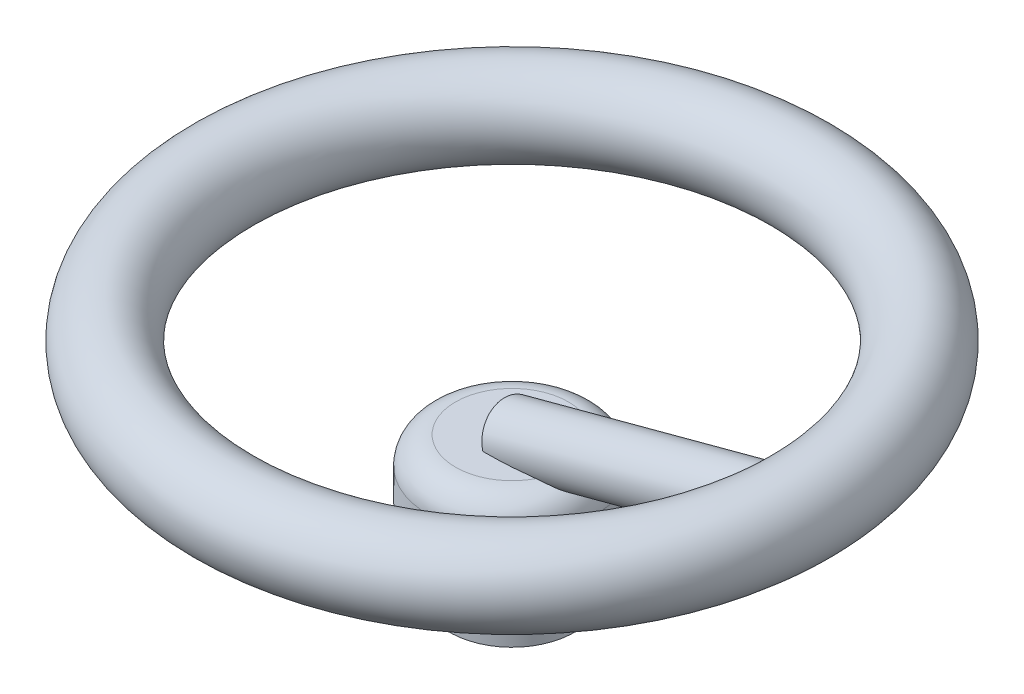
ISO-10303-21;
HEADER;
FILE_DESCRIPTION(('STEP AP214'),'2;1');
FILE_NAME('part.step','',(''),(''),'','','');
FILE_SCHEMA(('AUTOMOTIVE_DESIGN { 1 0 10303 214 1 1 1 1 }'));
ENDSEC;
DATA;
#1=APPLICATION_CONTEXT('core data for automotive mechanical design processes');
#2=APPLICATION_PROTOCOL_DEFINITION('international standard','automotive_design',2000,#1);
#3=PRODUCT_CONTEXT('',#1,'mechanical');
#4=PRODUCT('Part','Part','',(#3));
#5=PRODUCT_RELATED_PRODUCT_CATEGORY('part','',(#4));
#6=PRODUCT_DEFINITION_FORMATION('','',#4);
#7=PRODUCT_DEFINITION_CONTEXT('part definition',#1,'design');
#8=PRODUCT_DEFINITION('design','',#6,#7);
#9=PRODUCT_DEFINITION_SHAPE('','',#8);
#10=(LENGTH_UNIT() NAMED_UNIT(*) SI_UNIT(.MILLI.,.METRE.));
#11=(NAMED_UNIT(*) PLANE_ANGLE_UNIT() SI_UNIT($,.RADIAN.));
#12=(NAMED_UNIT(*) SI_UNIT($,.STERADIAN.) SOLID_ANGLE_UNIT());
#13=UNCERTAINTY_MEASURE_WITH_UNIT(LENGTH_MEASURE(1.E-05),#10,'distance_accuracy_value','');
#14=(GEOMETRIC_REPRESENTATION_CONTEXT(3) GLOBAL_UNCERTAINTY_ASSIGNED_CONTEXT((#13)) GLOBAL_UNIT_ASSIGNED_CONTEXT((#10,
#11,#12)) REPRESENTATION_CONTEXT('',''));
#15=CARTESIAN_POINT('',(0.,0.,0.));
#16=DIRECTION('',(0.,0.,1.));
#17=DIRECTION('',(1.,0.,0.));
#18=AXIS2_PLACEMENT_3D('',#15,#16,#17);
#19=CARTESIAN_POINT('',(0.,0.,0.));
#20=DIRECTION('',(0.,-1.,0.));
#21=DIRECTION('',(1.,0.,0.));
#22=AXIS2_PLACEMENT_3D('',#19,#20,#21);
#23=PLANE('',#22);
#24=CARTESIAN_POINT('',(0.,0.,0.));
#25=DIRECTION('',(0.,-1.,0.));
#26=DIRECTION('',(-1.,0.,0.));
#27=AXIS2_PLACEMENT_3D('',#24,#25,#26);
#28=ELLIPSE('',#27,23.657072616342,6.12290094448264);
#29=CARTESIAN_POINT('',(0.,0.,6.12290094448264));
#30=VERTEX_POINT('',#29);
#31=CARTESIAN_POINT('',(10.5181258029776,0.,5.48443672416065));
#32=VERTEX_POINT('',#31);
#33=EDGE_CURVE('E47',#30,#32,#28,.F.);
#34=ORIENTED_EDGE('',*,*,#33,.F.);
#35=DIRECTION('',(0.,0.,1.));
#36=VECTOR('',#35,1.);
#37=CARTESIAN_POINT('',(0.,0.,0.));
#38=LINE('',#37,#36);
#39=CARTESIAN_POINT('',(0.,0.,-6.12290094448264));
#40=VERTEX_POINT('',#39);
#41=EDGE_CURVE('E11',#40,#30,#38,.T.);
#42=ORIENTED_EDGE('',*,*,#41,.F.);
#43=CARTESIAN_POINT('',(10.5181258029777,0.,-5.48443672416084));
#44=VERTEX_POINT('',#43);
#45=EDGE_CURVE('E62',#44,#40,#28,.F.);
#46=ORIENTED_EDGE('',*,*,#45,.F.);
#47=CARTESIAN_POINT('',(0.,0.,0.));
#48=DIRECTION('',(0.,1.,0.));
#49=DIRECTION('',(-1.,0.,0.));
#50=AXIS2_PLACEMENT_3D('',#47,#48,#49);
#51=CIRCLE('',#50,11.8621252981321);
#52=EDGE_CURVE('E57',#44,#32,#51,.T.);
#53=ORIENTED_EDGE('',*,*,#52,.T.);
#54=EDGE_LOOP('',(#34,#42,#46,#53));
#55=FACE_BOUND('',#54,.T.);
#56=ADVANCED_FACE('F33',(#55),#23,.F.);
#57=CARTESIAN_POINT('',(0.,-5.72295049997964,0.));
#58=DIRECTION('',(0.,1.,0.));
#59=DIRECTION('',(-1.,0.,0.));
#60=AXIS2_PLACEMENT_3D('',#57,#58,#59);
#61=TOROIDAL_SURFACE('',#60,11.8621252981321,5.72295049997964);
#62=CARTESIAN_POINT('',(0.,-5.72295049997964,0.));
#63=DIRECTION('',(0.,1.,0.));
#64=DIRECTION('',(-1.,0.,0.));
#65=AXIS2_PLACEMENT_3D('',#62,#63,#64);
#66=CIRCLE('',#65,17.5850757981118);
#67=CARTESIAN_POINT('',(-17.5850757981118,-5.72295049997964,0.));
#68=VERTEX_POINT('',#67);
#69=EDGE_CURVE('E60',#68,#68,#66,.T.);
#70=ORIENTED_EDGE('',*,*,#69,.T.);
#71=EDGE_LOOP('',(#70));
#72=FACE_BOUND('',#71,.T.);
#73=CARTESIAN_POINT('',(5.34523472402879,-2.26781724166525,-4.97156903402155));
#74=CARTESIAN_POINT('',(5.3037001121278,-2.35630006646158,-4.91784921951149));
#75=CARTESIAN_POINT('',(5.27120185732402,-2.44606167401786,-4.85899273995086));
#76=CARTESIAN_POINT('',(5.22564818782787,-2.62388686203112,-4.73199202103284));
#77=CARTESIAN_POINT('',(5.21260380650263,-2.71194945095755,-4.66384253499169));
#78=CARTESIAN_POINT('',(5.20267448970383,-2.90105199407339,-4.50500440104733));
#79=CARTESIAN_POINT('',(5.20984997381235,-3.00083059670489,-4.41261484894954));
#80=CARTESIAN_POINT('',(5.2416810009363,-3.19010628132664,-4.22044523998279));
#81=CARTESIAN_POINT('',(5.2664053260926,-3.27956129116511,-4.12063749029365));
#82=CARTESIAN_POINT('',(5.32495816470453,-3.44459166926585,-3.91993667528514));
#83=CARTESIAN_POINT('',(5.35836996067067,-3.52058683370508,-3.81925745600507));
#84=CARTESIAN_POINT('',(5.43023265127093,-3.66396462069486,-3.61357973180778));
#85=CARTESIAN_POINT('',(5.46868851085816,-3.73133862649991,-3.50857704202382));
#86=CARTESIAN_POINT('',(5.54752001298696,-3.85833287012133,-3.29444861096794));
#87=CARTESIAN_POINT('',(5.58789875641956,-3.91793996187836,-3.18531627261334));
#88=CARTESIAN_POINT('',(5.66824592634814,-4.02986223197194,-2.96329160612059));
#89=CARTESIAN_POINT('',(5.70821448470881,-4.0821798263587,-2.8504005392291));
#90=CARTESIAN_POINT('',(5.79189059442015,-4.18725076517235,-2.603816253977));
#91=CARTESIAN_POINT('',(5.83526361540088,-4.23889956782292,-2.46953657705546));
#92=CARTESIAN_POINT('',(5.91729470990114,-4.3334147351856,-2.19649501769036));
#93=CARTESIAN_POINT('',(5.95595225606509,-4.3762801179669,-2.05773263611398));
#94=CARTESIAN_POINT('',(6.02698849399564,-4.45326168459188,-1.77639529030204));
#95=CARTESIAN_POINT('',(6.05937431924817,-4.48738782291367,-1.63382486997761));
#96=CARTESIAN_POINT('',(6.11673645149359,-4.54691010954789,-1.34541043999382));
#97=CARTESIAN_POINT('',(6.14171322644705,-4.5723068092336,-1.1995666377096));
#98=CARTESIAN_POINT('',(6.18588343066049,-4.61680712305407,-0.887700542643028));
#99=CARTESIAN_POINT('',(6.20401788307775,-4.63478426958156,-0.721363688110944));
#100=CARTESIAN_POINT('',(6.2290709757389,-4.65953154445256,-0.387000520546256));
#101=CARTESIAN_POINT('',(6.23598862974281,-4.66630068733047,-0.218974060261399));
#102=CARTESIAN_POINT('',(6.23830429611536,-4.66857184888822,0.117210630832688));
#103=CARTESIAN_POINT('',(6.2337039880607,-4.66407551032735,0.285368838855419));
#104=CARTESIAN_POINT('',(6.21318701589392,-4.64385795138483,0.620296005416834));
#105=CARTESIAN_POINT('',(6.19727140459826,-4.62813777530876,0.787065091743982));
#106=CARTESIAN_POINT('',(6.15718721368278,-4.58795721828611,1.09943396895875));
#107=CARTESIAN_POINT('',(6.13412999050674,-4.5646598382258,1.24532989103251));
#108=CARTESIAN_POINT('',(6.08043866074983,-4.50938663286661,1.53405283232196));
#109=CARTESIAN_POINT('',(6.04980411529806,-4.47741030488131,1.67687967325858));
#110=CARTESIAN_POINT('',(5.98200015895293,-4.40477831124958,1.95898184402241));
#111=CARTESIAN_POINT('',(5.94481971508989,-4.36410796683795,2.09825071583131));
#112=CARTESIAN_POINT('',(5.86538365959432,-4.2740782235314,2.37243851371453));
#113=CARTESIAN_POINT('',(5.82312856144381,-4.22471970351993,2.50735787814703));
#114=CARTESIAN_POINT('',(5.73826208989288,-4.12063045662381,2.76373075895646));
#115=CARTESIAN_POINT('',(5.69585838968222,-4.06646949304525,2.88548524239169));
#116=CARTESIAN_POINT('',(5.6101246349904,-3.94991402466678,3.12474002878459));
#117=CARTESIAN_POINT('',(5.5667941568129,-3.88751568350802,3.24223831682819));
#118=CARTESIAN_POINT('',(5.48198610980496,-3.75401872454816,3.4723637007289));
#119=CARTESIAN_POINT('',(5.44050308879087,-3.68294839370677,3.58500509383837));
#120=CARTESIAN_POINT('',(5.36298448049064,-3.53103516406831,3.80537326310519));
#121=CARTESIAN_POINT('',(5.32694192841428,-3.45020500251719,3.91310619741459));
#122=CARTESIAN_POINT('',(5.27010166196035,-3.28996041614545,4.10799394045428));
#123=CARTESIAN_POINT('',(5.2478622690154,-3.21199074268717,4.19589107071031));
#124=CARTESIAN_POINT('',(5.21616040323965,-3.04796294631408,4.36627582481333));
#125=CARTESIAN_POINT('',(5.20667797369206,-2.96191768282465,4.44877170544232));
#126=CARTESIAN_POINT('',(5.20596359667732,-2.7813910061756,4.6076739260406));
#127=CARTESIAN_POINT('',(5.21502297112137,-2.68679759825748,4.68396317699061));
#128=CARTESIAN_POINT('',(5.24552957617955,-2.54279418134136,4.79041984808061));
#129=CARTESIAN_POINT('',(5.25851835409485,-2.49444008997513,4.82457631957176));
#130=CARTESIAN_POINT('',(5.29012314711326,-2.39764958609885,4.89004744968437));
#131=CARTESIAN_POINT('',(5.30873874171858,-2.34921318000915,4.92136232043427));
#132=CARTESIAN_POINT('',(5.3661136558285,-2.21968260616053,5.00158669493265));
#133=CARTESIAN_POINT('',(5.40991500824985,-2.13907965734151,5.04775409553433));
#134=CARTESIAN_POINT('',(5.51046671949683,-1.98183346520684,5.13192111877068));
#135=CARTESIAN_POINT('',(5.56723568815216,-1.9051961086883,5.16990884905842));
#136=CARTESIAN_POINT('',(5.72731511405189,-1.71308649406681,5.25925551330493));
#137=CARTESIAN_POINT('',(5.83827024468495,-1.60151373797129,5.30519791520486));
#138=CARTESIAN_POINT('',(6.07622213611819,-1.39165865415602,5.38407109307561));
#139=CARTESIAN_POINT('',(6.20326897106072,-1.29341988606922,5.41695986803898));
#140=CARTESIAN_POINT('',(6.45288371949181,-1.11972612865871,5.47000749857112));
#141=CARTESIAN_POINT('',(6.57433643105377,-1.042951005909,5.49118467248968));
#142=CARTESIAN_POINT('',(6.82336314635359,-0.898350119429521,5.52765697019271));
#143=CARTESIAN_POINT('',(6.95094156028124,-0.830530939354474,5.54294778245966));
#144=CARTESIAN_POINT('',(7.21085973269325,-0.70326345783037,5.5687278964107));
#145=CARTESIAN_POINT('',(7.34320569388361,-0.643826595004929,5.57921068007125));
#146=CARTESIAN_POINT('',(7.61151645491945,-0.533062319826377,5.59603279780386));
#147=CARTESIAN_POINT('',(7.7474821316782,-0.481736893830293,5.60237111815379));
#148=CARTESIAN_POINT('',(8.07841988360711,-0.367621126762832,5.6131584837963));
#149=CARTESIAN_POINT('',(8.27480161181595,-0.308715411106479,5.6157773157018));
#150=CARTESIAN_POINT('',(8.67154522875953,-0.206287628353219,5.61414563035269));
#151=CARTESIAN_POINT('',(8.87190850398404,-0.162771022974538,5.60989267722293));
#152=CARTESIAN_POINT('',(9.27502236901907,-0.0910511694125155,5.59442997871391));
#153=CARTESIAN_POINT('',(9.47777210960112,-0.0628426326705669,5.58322263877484));
#154=CARTESIAN_POINT('',(9.88423723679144,-0.0216224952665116,5.55332106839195));
#155=CARTESIAN_POINT('',(10.087952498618,-0.0086089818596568,5.53462778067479));
#156=CARTESIAN_POINT('',(10.495784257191,0.00247651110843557,5.48874063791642));
#157=CARTESIAN_POINT('',(10.6998983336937,0.000479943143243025,5.46150832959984));
#158=CARTESIAN_POINT('',(11.1059425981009,-0.0181492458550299,5.39734153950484));
#159=CARTESIAN_POINT('',(11.307872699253,-0.0347824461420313,5.36040667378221));
#160=CARTESIAN_POINT('',(11.7077167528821,-0.0818740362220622,5.27539011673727));
#161=CARTESIAN_POINT('',(11.905631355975,-0.112330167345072,5.22731024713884));
#162=CARTESIAN_POINT('',(12.295544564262,-0.185843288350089,5.11843207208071));
#163=CARTESIAN_POINT('',(12.4875435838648,-0.228899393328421,5.0576346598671));
#164=CARTESIAN_POINT('',(12.8563316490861,-0.324042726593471,4.92439052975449));
#165=CARTESIAN_POINT('',(13.0334217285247,-0.375717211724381,4.85248404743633));
#166=CARTESIAN_POINT('',(13.3783855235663,-0.487211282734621,4.69423850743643));
#167=CARTESIAN_POINT('',(13.5462591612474,-0.54703093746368,4.60789932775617));
#168=CARTESIAN_POINT('',(13.8707233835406,-0.672407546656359,4.41993759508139));
#169=CARTESIAN_POINT('',(14.0273252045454,-0.737958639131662,4.31833058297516));
#170=CARTESIAN_POINT('',(14.327573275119,-0.872156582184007,4.09925357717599));
#171=CARTESIAN_POINT('',(14.4712223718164,-0.940802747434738,3.98178708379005));
#172=CARTESIAN_POINT('',(14.724035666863,-1.06825890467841,3.74926903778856));
#173=CARTESIAN_POINT('',(14.8351768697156,-1.12704755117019,3.63635056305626));
#174=CARTESIAN_POINT('',(15.0458264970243,-1.24285765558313,3.39931786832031));
#175=CARTESIAN_POINT('',(15.1453368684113,-1.29987940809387,3.27520552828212));
#176=CARTESIAN_POINT('',(15.3318832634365,-1.41027171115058,3.01653030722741));
#177=CARTESIAN_POINT('',(15.4189257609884,-1.46364414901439,2.8819729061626));
#178=CARTESIAN_POINT('',(15.5799453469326,-1.56501241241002,2.60335202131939));
#179=CARTESIAN_POINT('',(15.653924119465,-1.61300893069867,2.45928976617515));
#180=CARTESIAN_POINT('',(15.7791307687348,-1.69595951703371,2.18322142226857));
#181=CARTESIAN_POINT('',(15.8320864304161,-1.7317995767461,2.05226118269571));
#182=CARTESIAN_POINT('',(15.9276726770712,-1.7974338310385,1.78516395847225));
#183=CARTESIAN_POINT('',(15.9703042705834,-1.82722861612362,1.64902748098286));
#184=CARTESIAN_POINT('',(16.0450698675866,-1.88004638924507,1.37266456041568));
#185=CARTESIAN_POINT('',(16.0772069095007,-1.90307133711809,1.23243931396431));
#186=CARTESIAN_POINT('',(16.1308928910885,-1.94181055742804,0.948982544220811));
#187=CARTESIAN_POINT('',(16.1524420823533,-1.95752500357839,0.805751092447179));
#188=CARTESIAN_POINT('',(16.1838847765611,-1.98053715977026,0.526379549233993));
#189=CARTESIAN_POINT('',(16.1944166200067,-1.98829523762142,0.390348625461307));
#190=CARTESIAN_POINT('',(16.2060808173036,-1.996890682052,0.11766838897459));
#191=CARTESIAN_POINT('',(16.2072134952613,-1.99772828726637,-0.0189809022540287));
#192=CARTESIAN_POINT('',(16.2000776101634,-1.99246587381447,-0.291876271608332));
#193=CARTESIAN_POINT('',(16.1918106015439,-1.98636700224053,-0.428122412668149));
#194=CARTESIAN_POINT('',(16.1658976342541,-1.967360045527,-0.699241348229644));
#195=CARTESIAN_POINT('',(16.1482516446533,-1.95445193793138,-0.834114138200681));
#196=CARTESIAN_POINT('',(16.1039319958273,-1.92231756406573,-1.09967688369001));
#197=CARTESIAN_POINT('',(16.0773852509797,-1.90318022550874,-1.23039882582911));
#198=CARTESIAN_POINT('',(16.0152751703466,-1.85892702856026,-1.48869626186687));
#199=CARTESIAN_POINT('',(15.9797088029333,-1.8338091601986,-1.61627068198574));
#200=CARTESIAN_POINT('',(15.8996850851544,-1.77812282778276,-1.86733708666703));
#201=CARTESIAN_POINT('',(15.8552300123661,-1.74755576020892,-1.99083010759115));
#202=CARTESIAN_POINT('',(15.7575780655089,-1.6815999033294,-2.23298033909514));
#203=CARTESIAN_POINT('',(15.7043807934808,-1.6462108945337,-2.35163732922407));
#204=CARTESIAN_POINT('',(15.5885581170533,-1.57076644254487,-2.58520936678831));
#205=CARTESIAN_POINT('',(15.5257984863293,-1.53064677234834,-2.70003707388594));
#206=CARTESIAN_POINT('',(15.3917628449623,-1.44706398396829,-2.92332687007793));
#207=CARTESIAN_POINT('',(15.3204865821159,-1.40360076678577,-3.03178877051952));
#208=CARTESIAN_POINT('',(15.1697826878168,-1.31427853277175,-3.24180733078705));
#209=CARTESIAN_POINT('',(15.0903564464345,-1.26841992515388,-3.34336516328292));
#210=CARTESIAN_POINT('',(14.9237276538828,-1.17526618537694,-3.5392502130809));
#211=CARTESIAN_POINT('',(14.8365219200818,-1.12797047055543,-3.63357444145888));
#212=CARTESIAN_POINT('',(14.6498855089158,-1.0303726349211,-3.81964196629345));
#213=CARTESIAN_POINT('',(14.5500475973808,-0.980047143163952,-3.91096444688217));
#214=CARTESIAN_POINT('',(14.3429480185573,-0.880115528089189,-4.08510134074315));
#215=CARTESIAN_POINT('',(14.2356886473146,-0.830509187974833,-4.16791836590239));
#216=CARTESIAN_POINT('',(14.0143258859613,-0.733087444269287,-4.32517782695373));
#217=CARTESIAN_POINT('',(13.9002183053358,-0.685273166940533,-4.39961505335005));
#218=CARTESIAN_POINT('',(13.6659609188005,-0.592525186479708,-4.54023947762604));
#219=CARTESIAN_POINT('',(13.5458123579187,-0.547590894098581,-4.60642836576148));
#220=CARTESIAN_POINT('',(13.2867929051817,-0.456853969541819,-4.73768284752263));
#221=CARTESIAN_POINT('',(13.1473081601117,-0.411489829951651,-4.801840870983));
#222=CARTESIAN_POINT('',(12.8627746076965,-0.32659891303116,-4.92101700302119));
#223=CARTESIAN_POINT('',(12.7177254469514,-0.287072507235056,-4.976034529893));
#224=CARTESIAN_POINT('',(12.4230412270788,-0.214815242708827,-5.07761441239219));
#225=CARTESIAN_POINT('',(12.2734058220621,-0.182084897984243,-5.12417612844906));
#226=CARTESIAN_POINT('',(11.9705073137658,-0.124200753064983,-5.20957492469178));
#227=CARTESIAN_POINT('',(11.8172438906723,-0.0990476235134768,-5.24841132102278));
#228=CARTESIAN_POINT('',(11.4859230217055,-0.0539230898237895,-5.32414566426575));
#229=CARTESIAN_POINT('',(11.3074495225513,-0.0352040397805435,-5.35997539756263));
#230=CARTESIAN_POINT('',(10.9482461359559,-0.00911873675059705,-5.4235645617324));
#231=CARTESIAN_POINT('',(10.7675160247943,-0.00175361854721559,-5.45132318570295));
#232=CARTESIAN_POINT('',(10.4047014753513,0.00120114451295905,-5.49974533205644));
#233=CARTESIAN_POINT('',(10.2226152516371,-0.00322933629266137,-5.52039666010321));
#234=CARTESIAN_POINT('',(9.858534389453,-0.0241508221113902,-5.55530881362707));
#235=CARTESIAN_POINT('',(9.67653974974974,-0.0406416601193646,-5.56956972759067));
#236=CARTESIAN_POINT('',(9.29299237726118,-0.0883813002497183,-5.59356026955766));
#237=CARTESIAN_POINT('',(9.09157662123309,-0.121098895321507,-5.60258750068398));
#238=CARTESIAN_POINT('',(8.69154433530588,-0.201751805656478,-5.61381765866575));
#239=CARTESIAN_POINT('',(8.49292883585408,-0.249692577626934,-5.61601813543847));
#240=CARTESIAN_POINT('',(8.10051605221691,-0.36079856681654,-5.61351483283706));
#241=CARTESIAN_POINT('',(7.90670884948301,-0.423928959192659,-5.60882672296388));
#242=CARTESIAN_POINT('',(7.52534046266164,-0.565786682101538,-5.59189522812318));
#243=CARTESIAN_POINT('',(7.33777438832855,-0.644501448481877,-5.57965791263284));
#244=CARTESIAN_POINT('',(6.98786381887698,-0.810462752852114,-5.54758446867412));
#245=CARTESIAN_POINT('',(6.82477587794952,-0.89628496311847,-5.52853949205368));
#246=CARTESIAN_POINT('',(6.50849231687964,-1.08271055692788,-5.48071187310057));
#247=CARTESIAN_POINT('',(6.35529870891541,-1.18331693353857,-5.45192725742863));
#248=CARTESIAN_POINT('',(6.08841345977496,-1.3827154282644,-5.38680821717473));
#249=CARTESIAN_POINT('',(5.97239125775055,-1.479021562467,-5.35252828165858));
#250=CARTESIAN_POINT('',(5.75660135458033,-1.68364142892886,-5.27123958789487));
#251=CARTESIAN_POINT('',(5.65677398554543,-1.79190849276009,-5.22427933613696));
#252=CARTESIAN_POINT('',(5.52466256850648,-1.96356548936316,-5.14069294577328));
#253=CARTESIAN_POINT('',(5.48324641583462,-2.02295924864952,-5.11027302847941));
#254=CARTESIAN_POINT('',(5.4081413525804,-2.14396352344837,-5.04460561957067));
#255=CARTESIAN_POINT('',(5.37445225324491,-2.20557398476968,-5.00935824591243));
#256=CARTESIAN_POINT('',(5.34523472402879,-2.26781724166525,-4.97156903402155));
#257=B_SPLINE_CURVE_WITH_KNOTS('',3,(#73,#74,#75,#76,#77,#78,#79,#80,#81,#82,#83,#84,#85,#86,
#87,#88,#89,#90,#91,#92,#93,#94,#95,#96,#97,#98,#99,#100,#101,#102,#103,#104,#105,#106,#107,
#108,#109,#110,#111,#112,#113,#114,#115,#116,#117,#118,#119,#120,#121,#122,#123,#124,#125,#126,
#127,#128,#129,#130,#131,#132,#133,#134,#135,#136,#137,#138,#139,#140,#141,#142,#143,#144,#145,
#146,#147,#148,#149,#150,#151,#152,#153,#154,#155,#156,#157,#158,#159,#160,#161,#162,#163,#164,
#165,#166,#167,#168,#169,#170,#171,#172,#173,#174,#175,#176,#177,#178,#179,#180,#181,#182,#183,
#184,#185,#186,#187,#188,#189,#190,#191,#192,#193,#194,#195,#196,#197,#198,#199,#200,#201,#202,
#203,#204,#205,#206,#207,#208,#209,#210,#211,#212,#213,#214,#215,#216,#217,#218,#219,#220,#221,
#222,#223,#224,#225,#226,#227,#228,#229,#230,#231,#232,#233,#234,#235,#236,#237,#238,#239,#240,
#241,#242,#243,#244,#245,#246,#247,#248,#249,#250,#251,#252,#253,#254,#255,#256),.UNSPECIFIED.,
.T.,.F.,(4,2,2,2,2,2,2,2,2,2,2,2,2,2,2,2,2,2,2,2,2,2,2,2,2,2,2,2,2,2,2,2,2,2,2,2,2,2,2,2,2,2,2,
2,2,2,2,2,2,2,2,2,2,2,2,2,2,2,2,2,2,2,2,2,2,2,2,2,2,2,2,2,2,2,2,2,2,2,2,2,2,2,2,2,2,2,2,2,2,2,2,
4),(0.,0.334255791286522,0.668701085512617,1.07479330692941,1.4824860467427,1.87339440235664,
2.26469046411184,2.65664044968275,3.04846021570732,3.49886670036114,3.94932351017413,
4.39926491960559,4.84917790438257,5.35328308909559,5.85743259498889,6.36150858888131,
6.86553768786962,7.31365459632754,7.76179746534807,8.21070302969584,8.65956320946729,
9.07879137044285,9.49821547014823,9.91630630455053,10.3338572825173,10.6918081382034,
11.049198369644,11.412246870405,11.5937765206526,11.7752926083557,12.0818660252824,
12.3888822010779,12.8778359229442,13.3683503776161,13.80345574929,14.238879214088,
14.6748912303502,15.1110098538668,15.7253295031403,16.3398669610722,16.954191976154,
17.5684396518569,18.1854941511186,18.8025730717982,19.4195511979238,20.0364860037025,
20.6296076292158,21.2227342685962,21.8152612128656,22.4076575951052,22.9139040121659,
23.4200655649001,23.9259633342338,24.431795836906,24.8684467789,25.3050550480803,
25.7415367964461,26.1780081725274,26.5874900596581,26.9969578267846,27.4063578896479,
27.8157593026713,28.2195552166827,28.6234870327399,29.0273154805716,29.431162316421,
29.8413140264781,30.2514778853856,30.6615719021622,31.0718344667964,31.5044559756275,
31.9369442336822,32.3696998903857,32.8023667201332,33.2821591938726,33.7619821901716,
34.2418414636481,34.7217431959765,35.2701549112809,35.8186214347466,36.3680243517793,
36.9174196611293,37.5294810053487,38.1417619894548,38.7526523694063,39.3630522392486,
39.918009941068,40.4730801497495,40.9357482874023,41.3966710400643,41.6318090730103,
41.8669413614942),.UNSPECIFIED.);
#258=EDGE_CURVE('E40',#32,#44,#257,.T.);
#259=ORIENTED_EDGE('',*,*,#258,.F.);
#260=ORIENTED_EDGE('',*,*,#52,.F.);
#261=EDGE_LOOP('',(#259,#260));
#262=FACE_BOUND('',#261,.T.);
#263=ADVANCED_FACE('F58',(#72,#262),#61,.T.);
#264=CARTESIAN_POINT('',(0.,0.,0.));
#265=DIRECTION('',(0.,1.,0.));
#266=DIRECTION('',(-1.,0.,0.));
#267=AXIS2_PLACEMENT_3D('',#264,#265,#266);
#268=CYLINDRICAL_SURFACE('',#267,17.5850757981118);
#269=ORIENTED_EDGE('',*,*,#69,.F.);
#270=EDGE_LOOP('',(#269));
#271=FACE_BOUND('',#270,.T.);
#272=CARTESIAN_POINT('',(0.,-12.382969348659,0.));
#273=DIRECTION('',(0.,1.,0.));
#274=DIRECTION('',(-1.,0.,0.));
#275=AXIS2_PLACEMENT_3D('',#272,#273,#274);
#276=CIRCLE('',#275,17.5850757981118);
#277=CARTESIAN_POINT('',(-17.5850757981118,-12.382969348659,0.));
#278=VERTEX_POINT('',#277);
#279=EDGE_CURVE('E100',#278,#278,#276,.T.);
#280=ORIENTED_EDGE('',*,*,#279,.T.);
#281=EDGE_LOOP('',(#280));
#282=FACE_BOUND('',#281,.T.);
#283=ADVANCED_FACE('F106',(#271,#282),#268,.T.);
#284=CARTESIAN_POINT('',(17.5850757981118,-12.382969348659,0.));
#285=DIRECTION('',(0.,1.,0.));
#286=DIRECTION('',(-1.,0.,0.));
#287=AXIS2_PLACEMENT_3D('',#284,#285,#286);
#288=PLANE('',#287);
#289=ORIENTED_EDGE('',*,*,#279,.F.);
#290=EDGE_LOOP('',(#289));
#291=FACE_BOUND('',#290,.T.);
#292=CARTESIAN_POINT('',(0.,-12.382969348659,0.));
#293=DIRECTION('',(0.,1.,0.));
#294=DIRECTION('',(-1.,0.,0.));
#295=AXIS2_PLACEMENT_3D('',#292,#293,#294);
#296=CIRCLE('',#295,13.0620975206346);
#297=CARTESIAN_POINT('',(-13.0620975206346,-12.382969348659,0.));
#298=VERTEX_POINT('',#297);
#299=EDGE_CURVE('E97',#298,#298,#296,.T.);
#300=ORIENTED_EDGE('',*,*,#299,.T.);
#301=EDGE_LOOP('',(#300));
#302=FACE_BOUND('',#301,.T.);
#303=ADVANCED_FACE('F109',(#291,#302),#288,.F.);
#304=CARTESIAN_POINT('',(0.,0.,0.));
#305=DIRECTION('',(0.,1.,0.));
#306=DIRECTION('',(-1.,0.,0.));
#307=AXIS2_PLACEMENT_3D('',#304,#305,#306);
#308=CYLINDRICAL_SURFACE('',#307,13.0620975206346);
#309=ORIENTED_EDGE('',*,*,#299,.F.);
#310=EDGE_LOOP('',(#309));
#311=FACE_BOUND('',#310,.T.);
#312=CARTESIAN_POINT('',(0.,-29.4270498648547,0.));
#313=DIRECTION('',(0.,1.,0.));
#314=DIRECTION('',(-1.,0.,0.));
#315=AXIS2_PLACEMENT_3D('',#312,#313,#314);
#316=CIRCLE('',#315,13.0620975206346);
#317=CARTESIAN_POINT('',(-13.0620975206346,-29.4270498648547,0.));
#318=VERTEX_POINT('',#317);
#319=EDGE_CURVE('E94',#318,#318,#316,.T.);
#320=ORIENTED_EDGE('',*,*,#319,.T.);
#321=EDGE_LOOP('',(#320));
#322=FACE_BOUND('',#321,.T.);
#323=ADVANCED_FACE('F114',(#311,#322),#308,.T.);
#324=CARTESIAN_POINT('',(13.0620975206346,-29.4270498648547,0.));
#325=DIRECTION('',(0.,1.,0.));
#326=DIRECTION('',(-1.,0.,0.));
#327=AXIS2_PLACEMENT_3D('',#324,#325,#326);
#328=PLANE('',#327);
#329=ORIENTED_EDGE('',*,*,#319,.F.);
#330=EDGE_LOOP('',(#329));
#331=FACE_BOUND('',#330,.T.);
#332=ADVANCED_FACE('F84',(#331),#328,.F.);
#333=CARTESIAN_POINT('',(0.,0.,0.));
#334=DIRECTION('',(0.965925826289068,0.258819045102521,0.));
#335=DIRECTION('',(-0.258819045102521,0.965925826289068,0.));
#336=AXIS2_PLACEMENT_3D('',#333,#334,#335);
#337=PLANE('',#336);
#338=CARTESIAN_POINT('',(0.,0.,0.));
#339=DIRECTION('',(0.965925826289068,0.258819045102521,0.));
#340=DIRECTION('',(-0.258819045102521,0.965925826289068,0.));
#341=AXIS2_PLACEMENT_3D('',#338,#339,#340);
#342=CIRCLE('',#341,6.12290094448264);
#343=EDGE_CURVE('E66',#40,#30,#342,.T.);
#344=ORIENTED_EDGE('',*,*,#343,.F.);
#345=ORIENTED_EDGE('',*,*,#41,.T.);
#346=EDGE_LOOP('',(#344,#345));
#347=FACE_BOUND('',#346,.T.);
#348=ADVANCED_FACE('F80',(#347),#337,.F.);
#349=CARTESIAN_POINT('',(500001.584723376,133975.02084091,0.));
#350=DIRECTION('',(-0.965925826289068,-0.258819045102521,0.));
#351=DIRECTION('',(0.258819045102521,-0.965925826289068,0.));
#352=AXIS2_PLACEMENT_3D('',#349,#350,#351);
#353=CYLINDRICAL_SURFACE('',#352,6.12290094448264);
#354=CARTESIAN_POINT('',(51.4897528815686,15.6988828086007,-5.8406999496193));
#355=CARTESIAN_POINT('',(51.4699230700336,15.8576067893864,-5.79085195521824));
#356=CARTESIAN_POINT('',(51.4554709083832,16.0150836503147,-5.73472581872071));
#357=CARTESIAN_POINT('',(51.436566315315,16.3260457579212,-5.61073254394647));
#358=CARTESIAN_POINT('',(51.4321220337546,16.4795276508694,-5.54285588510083));
#359=CARTESIAN_POINT('',(51.4322466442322,16.7816257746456,-5.39604715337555));
#360=CARTESIAN_POINT('',(51.4368411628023,16.9302269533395,-5.31708423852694));
#361=CARTESIAN_POINT('',(51.4539513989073,17.2211911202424,-5.14905530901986));
#362=CARTESIAN_POINT('',(51.4664710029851,17.3635510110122,-5.05998435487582));
#363=CARTESIAN_POINT('',(51.4980577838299,17.6398044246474,-4.87344908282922));
#364=CARTESIAN_POINT('',(51.517058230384,17.7737683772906,-4.77607760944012));
#365=CARTESIAN_POINT('',(51.560403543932,18.0340887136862,-4.57284009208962));
#366=CARTESIAN_POINT('',(51.5847480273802,18.1604456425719,-4.4669746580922));
#367=CARTESIAN_POINT('',(51.6640137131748,18.5274549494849,-4.13721853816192));
#368=CARTESIAN_POINT('',(51.7251744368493,18.7561015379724,-3.9011303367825));
#369=CARTESIAN_POINT('',(51.8264176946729,19.0865182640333,-3.50664194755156));
#370=CARTESIAN_POINT('',(51.8643833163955,19.2008504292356,-3.35797914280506));
#371=CARTESIAN_POINT('',(51.9403918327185,19.4162302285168,-3.05132241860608));
#372=CARTESIAN_POINT('',(51.9784347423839,19.5172749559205,-2.89332646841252));
#373=CARTESIAN_POINT('',(52.0893244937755,19.7981391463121,-2.40640597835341));
#374=CARTESIAN_POINT('',(52.1591840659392,19.9564409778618,-2.06366521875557));
#375=CARTESIAN_POINT('',(52.2555762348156,20.1652576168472,-1.45450900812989));
#376=CARTESIAN_POINT('',(52.2888097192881,20.2337863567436,-1.19534356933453));
#377=CARTESIAN_POINT('',(52.3245244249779,20.3063814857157,-0.800041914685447));
#378=CARTESIAN_POINT('',(52.3340725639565,20.3255454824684,-0.667228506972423));
#379=CARTESIAN_POINT('',(52.3480455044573,20.3534739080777,-0.400215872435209));
#380=CARTESIAN_POINT('',(52.3524702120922,20.3622381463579,-0.266016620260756));
#381=CARTESIAN_POINT('',(52.3559649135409,20.369166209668,0.00305566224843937));
#382=CARTESIAN_POINT('',(52.3550216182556,20.3673037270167,0.137929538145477));
#383=CARTESIAN_POINT('',(52.3478010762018,20.3529633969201,0.40696210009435));
#384=CARTESIAN_POINT('',(52.3415239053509,20.3404857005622,0.541120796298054));
#385=CARTESIAN_POINT('',(52.3239422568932,20.3051730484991,0.807847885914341));
#386=CARTESIAN_POINT('',(52.3126332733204,20.2823288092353,0.940414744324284));
#387=CARTESIAN_POINT('',(52.2855202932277,20.2267307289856,1.20303600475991));
#388=CARTESIAN_POINT('',(52.2697140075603,20.1939718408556,1.33308909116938));
#389=CARTESIAN_POINT('',(52.2305830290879,20.1112667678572,1.61688749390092));
#390=CARTESIAN_POINT('',(52.2063767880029,20.0591569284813,1.76988191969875));
#391=CARTESIAN_POINT('',(52.1537740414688,19.9423506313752,2.07031059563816));
#392=CARTESIAN_POINT('',(52.1253747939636,19.8776459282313,2.21774112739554));
#393=CARTESIAN_POINT('',(52.0658113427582,19.736671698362,2.50652809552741));
#394=CARTESIAN_POINT('',(52.034644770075,19.6603922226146,2.6478791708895));
#395=CARTESIAN_POINT('',(51.9709863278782,19.4972931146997,2.92396124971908));
#396=CARTESIAN_POINT('',(51.9384946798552,19.4104752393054,3.05869335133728));
#397=CARTESIAN_POINT('',(51.8398943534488,19.132168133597,3.45731141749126));
#398=CARTESIAN_POINT('',(51.7737777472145,18.9253005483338,3.71063300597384));
#399=CARTESIAN_POINT('',(51.6520968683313,18.4763755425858,4.18716224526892));
#400=CARTESIAN_POINT('',(51.5965405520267,18.2342918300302,4.41034715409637));
#401=CARTESIAN_POINT('',(51.5246279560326,17.8257983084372,4.73787688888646));
#402=CARTESIAN_POINT('',(51.5015531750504,17.669332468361,4.85328409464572));
#403=CARTESIAN_POINT('',(51.464434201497,17.3467433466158,5.07155230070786));
#404=CARTESIAN_POINT('',(51.4503917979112,17.1806181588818,5.17441081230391));
#405=CARTESIAN_POINT('',(51.4332841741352,16.8403578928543,5.36614578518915));
#406=CARTESIAN_POINT('',(51.4301968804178,16.6662396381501,5.45505001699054));
#407=CARTESIAN_POINT('',(51.4367036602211,16.3113351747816,5.61775412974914));
#408=CARTESIAN_POINT('',(51.4462909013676,16.1305526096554,5.69156212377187));
#409=CARTESIAN_POINT('',(51.4745774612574,15.8193663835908,5.80305066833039));
#410=CARTESIAN_POINT('',(51.4896802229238,15.6901198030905,5.84492668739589));
#411=CARTESIAN_POINT('',(51.5271484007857,15.4302307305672,5.92021127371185));
#412=CARTESIAN_POINT('',(51.5495121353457,15.2995885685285,5.95362179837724));
#413=CARTESIAN_POINT('',(51.6016957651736,15.0379223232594,6.01161643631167));
#414=CARTESIAN_POINT('',(51.6315108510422,14.9068985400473,6.03620621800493));
#415=CARTESIAN_POINT('',(51.6986372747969,14.6453789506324,6.07636038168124));
#416=CARTESIAN_POINT('',(51.7359489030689,14.5148831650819,6.09192441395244));
#417=CARTESIAN_POINT('',(51.8179524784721,14.2553140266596,6.11394361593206));
#418=CARTESIAN_POINT('',(51.8626514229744,14.1262421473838,6.1203900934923));
#419=CARTESIAN_POINT('',(51.9590704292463,13.8706166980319,6.1242059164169));
#420=CARTESIAN_POINT('',(52.0107904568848,13.7440631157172,6.12157530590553));
#421=CARTESIAN_POINT('',(52.1207735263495,13.4943255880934,6.10744030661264));
#422=CARTESIAN_POINT('',(52.1790375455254,13.3711421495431,6.09593459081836));
#423=CARTESIAN_POINT('',(52.3015234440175,13.1288532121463,6.06436966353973));
#424=CARTESIAN_POINT('',(52.3657477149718,13.0097493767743,6.04430700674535));
#425=CARTESIAN_POINT('',(52.4995840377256,12.7760394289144,5.99599913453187));
#426=CARTESIAN_POINT('',(52.5692054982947,12.6614417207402,5.96773938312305));
#427=CARTESIAN_POINT('',(52.713027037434,12.4373824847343,5.90352710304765));
#428=CARTESIAN_POINT('',(52.7872285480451,12.3279225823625,5.86757215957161));
#429=CARTESIAN_POINT('',(53.0156595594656,12.0076939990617,5.74888083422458));
#430=CARTESIAN_POINT('',(53.1757678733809,11.8049864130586,5.65529872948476));
#431=CARTESIAN_POINT('',(53.4618484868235,11.4735159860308,5.47149601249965));
#432=CARTESIAN_POINT('',(53.585542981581,11.3394461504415,5.38702942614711));
#433=CARTESIAN_POINT('',(53.8364670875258,11.08336257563,5.20588316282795));
#434=CARTESIAN_POINT('',(53.9636969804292,10.9613498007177,5.10920251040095));
#435=CARTESIAN_POINT('',(54.2201943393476,10.7288797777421,4.90442290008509));
#436=CARTESIAN_POINT('',(54.3494659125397,10.6184505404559,4.79629747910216));
#437=CARTESIAN_POINT('',(54.6080690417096,10.4090875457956,4.56957183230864));
#438=CARTESIAN_POINT('',(54.7374005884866,10.3101523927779,4.4509728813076));
#439=CARTESIAN_POINT('',(54.9968519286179,10.1216181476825,4.2014621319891));
#440=CARTESIAN_POINT('',(55.1269417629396,10.0322265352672,4.07036258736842));
#441=CARTESIAN_POINT('',(55.3835882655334,9.86451176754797,3.79795416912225));
#442=CARTESIAN_POINT('',(55.5101441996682,9.78619089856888,3.65664319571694));
#443=CARTESIAN_POINT('',(55.757315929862,9.64042696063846,3.36398544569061));
#444=CARTESIAN_POINT('',(55.8779404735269,9.57296751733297,3.21265427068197));
#445=CARTESIAN_POINT('',(56.110667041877,9.4486262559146,2.89956439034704));
#446=CARTESIAN_POINT('',(56.2227734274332,9.39173900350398,2.73781110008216));
#447=CARTESIAN_POINT('',(56.461848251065,9.27545138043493,2.36123037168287));
#448=CARTESIAN_POINT('',(56.5854549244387,9.21902260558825,2.14329189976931));
#449=CARTESIAN_POINT('',(56.8045761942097,9.12318986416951,1.69026854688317));
#450=CARTESIAN_POINT('',(56.9001438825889,9.08375365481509,1.45521713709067));
#451=CARTESIAN_POINT('',(57.0384793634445,9.02820134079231,1.01241006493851));
#452=CARTESIAN_POINT('',(57.0875433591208,9.00922031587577,0.807028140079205));
#453=CARTESIAN_POINT('',(57.1525276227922,8.98427903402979,0.390369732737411));
#454=CARTESIAN_POINT('',(57.1684910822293,8.97830180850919,0.179101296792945));
#455=CARTESIAN_POINT('',(57.1649532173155,8.97964002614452,-0.243402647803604));
#456=CARTESIAN_POINT('',(57.1453998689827,8.98697496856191,-0.454637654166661));
#457=CARTESIAN_POINT('',(57.0736519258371,9.0146023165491,-0.870643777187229));
#458=CARTESIAN_POINT('',(57.0214112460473,9.03491301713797,-1.07540533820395));
#459=CARTESIAN_POINT('',(56.8659437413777,9.09773960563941,-1.5494769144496));
#460=CARTESIAN_POINT('',(56.7509394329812,9.14572862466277,-1.81416758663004));
#461=CARTESIAN_POINT('',(56.5536680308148,9.23394186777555,-2.19413164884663));
#462=CARTESIAN_POINT('',(56.4836327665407,9.26612491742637,-2.31815174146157));
#463=CARTESIAN_POINT('',(56.3369094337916,9.33585849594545,-2.56063302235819));
#464=CARTESIAN_POINT('',(56.2602227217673,9.37340793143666,-2.67909533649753));
#465=CARTESIAN_POINT('',(56.0624957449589,9.47370048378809,-2.96769606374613));
#466=CARTESIAN_POINT('',(55.9382420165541,9.53973235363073,-3.13448905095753));
#467=CARTESIAN_POINT('',(55.6818135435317,9.68385707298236,-3.4564164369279));
#468=CARTESIAN_POINT('',(55.5496351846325,9.76195545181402,-3.6115454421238));
#469=CARTESIAN_POINT('',(55.2800865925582,9.93064180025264,-3.91050060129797));
#470=CARTESIAN_POINT('',(55.1427095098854,10.0212466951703,-4.0543110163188));
#471=CARTESIAN_POINT('',(54.8653663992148,10.2152993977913,-4.33024493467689));
#472=CARTESIAN_POINT('',(54.725400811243,10.3187450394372,-4.46237040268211));
#473=CARTESIAN_POINT('',(54.44220668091,10.5412228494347,-4.71700682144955));
#474=CARTESIAN_POINT('',(54.2989690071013,10.6605260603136,-4.83927173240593));
#475=CARTESIAN_POINT('',(54.0142535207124,10.9136206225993,-5.07026119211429));
#476=CARTESIAN_POINT('',(53.8727760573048,11.0474147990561,-5.17898309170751));
#477=CARTESIAN_POINT('',(53.5944220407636,11.329444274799,-5.38120334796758));
#478=CARTESIAN_POINT('',(53.4575326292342,11.4776337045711,-5.4747476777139));
#479=CARTESIAN_POINT('',(53.1905389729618,11.7888701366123,-5.64526646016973));
#480=CARTESIAN_POINT('',(53.0604303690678,11.9519074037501,-5.72225166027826));
#481=CARTESIAN_POINT('',(52.8535546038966,12.2329816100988,-5.83405676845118));
#482=CARTESIAN_POINT('',(52.7740104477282,12.3468806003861,-5.87421801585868));
#483=CARTESIAN_POINT('',(52.6198246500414,12.5804936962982,-5.94610626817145));
#484=CARTESIAN_POINT('',(52.5451815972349,12.7002061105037,-5.97783570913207));
#485=CARTESIAN_POINT('',(52.4016362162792,12.9449792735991,-6.03229822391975));
#486=CARTESIAN_POINT('',(52.3327327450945,13.0700389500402,-6.05503309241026));
#487=CARTESIAN_POINT('',(52.2014539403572,13.3248776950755,-6.09100967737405));
#488=CARTESIAN_POINT('',(52.1390786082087,13.4546567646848,-6.10425139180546));
#489=CARTESIAN_POINT('',(52.0212336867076,13.718863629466,-6.12088859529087));
#490=CARTESIAN_POINT('',(51.9658071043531,13.8533143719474,-6.12422541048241));
#491=CARTESIAN_POINT('',(51.8628823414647,14.125108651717,-6.12063012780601));
#492=CARTESIAN_POINT('',(51.8153851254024,14.2624525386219,-6.11369678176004));
#493=CARTESIAN_POINT('',(51.728798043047,14.5386218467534,-6.08950992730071));
#494=CARTESIAN_POINT('',(51.6896947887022,14.6774445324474,-6.07227302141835));
#495=CARTESIAN_POINT('',(51.6199848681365,14.9555171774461,-6.02762182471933));
#496=CARTESIAN_POINT('',(51.5893736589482,15.0947668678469,-6.00021299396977));
#497=CARTESIAN_POINT('',(51.5481504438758,15.3115497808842,-5.94973030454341));
#498=CARTESIAN_POINT('',(51.5346572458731,15.3893486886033,-5.93003288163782));
#499=CARTESIAN_POINT('',(51.510272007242,15.5444905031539,-5.88761587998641));
#500=CARTESIAN_POINT('',(51.4993788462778,15.6218335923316,-5.86489760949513));
#501=CARTESIAN_POINT('',(51.4897528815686,15.6988828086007,-5.8406999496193));
#502=B_SPLINE_CURVE_WITH_KNOTS('',3,(#354,#355,#356,#357,#358,#359,#360,#361,#362,#363,#364,
#365,#366,#367,#368,#369,#370,#371,#372,#373,#374,#375,#376,#377,#378,#379,#380,#381,#382,#383,
#384,#385,#386,#387,#388,#389,#390,#391,#392,#393,#394,#395,#396,#397,#398,#399,#400,#401,#402,
#403,#404,#405,#406,#407,#408,#409,#410,#411,#412,#413,#414,#415,#416,#417,#418,#419,#420,#421,
#422,#423,#424,#425,#426,#427,#428,#429,#430,#431,#432,#433,#434,#435,#436,#437,#438,#439,#440,
#441,#442,#443,#444,#445,#446,#447,#448,#449,#450,#451,#452,#453,#454,#455,#456,#457,#458,#459,
#460,#461,#462,#463,#464,#465,#466,#467,#468,#469,#470,#471,#472,#473,#474,#475,#476,#477,#478,
#479,#480,#481,#482,#483,#484,#485,#486,#487,#488,#489,#490,#491,#492,#493,#494,#495,#496,#497,
#498,#499,#500,#501),.UNSPECIFIED.,.T.,.F.,(4,2,2,2,2,2,2,2,2,2,2,2,2,2,2,2,2,2,2,2,2,2,2,2,2,2,
2,2,2,2,2,2,2,2,2,2,2,2,2,2,2,2,2,2,2,2,2,2,2,2,2,2,2,2,2,2,2,2,2,2,2,2,2,2,2,2,2,2,2,2,2,2,2,
4),(0.,0.502535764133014,1.00548061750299,1.50985345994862,2.01447384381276,2.51404783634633,
3.01358598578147,4.01246123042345,4.58591163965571,5.15948728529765,6.30312143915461,
7.10993872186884,7.51307456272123,7.91621779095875,8.32035947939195,8.72449541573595,
9.12899398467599,9.53369881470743,10.0232726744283,10.5131681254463,11.0034870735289,
11.4937243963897,12.4910632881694,13.4891506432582,14.0757894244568,14.6625443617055,
15.248116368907,15.8333728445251,16.2430491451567,16.6526306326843,17.0619484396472,
17.4712821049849,17.8810057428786,18.2907273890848,18.7005103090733,19.1104583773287,
19.521137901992,19.9319464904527,20.7532489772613,21.3556134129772,21.9580259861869,
22.5618632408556,23.1656270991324,23.7806024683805,24.3957046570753,25.0098706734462,
25.6237201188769,26.392079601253,27.1589746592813,27.792334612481,28.4248676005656,
29.0583278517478,29.6926832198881,30.5651384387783,31.0029677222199,31.4407079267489,
32.0944528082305,32.7484981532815,33.4034374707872,34.0582664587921,34.7262315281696,
35.3943270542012,36.0603595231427,36.725958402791,37.1594088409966,37.5927339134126,
38.0259724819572,38.4592111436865,38.895011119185,39.3308640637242,39.7660165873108,
40.2009358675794,40.4449866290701,40.6889320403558),.UNSPECIFIED.);
#503=CARTESIAN_POINT('',(51.4897528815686,15.6988828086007,-5.8406999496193));
#504=VERTEX_POINT('',#503);
#505=EDGE_CURVE('E88',#504,#504,#502,.T.);
#506=ORIENTED_EDGE('',*,*,#505,.F.);
#507=EDGE_LOOP('',(#506));
#508=FACE_BOUND('',#507,.T.);
#509=ORIENTED_EDGE('',*,*,#343,.T.);
#510=ORIENTED_EDGE('',*,*,#33,.T.);
#511=ORIENTED_EDGE('',*,*,#258,.T.);
#512=ORIENTED_EDGE('',*,*,#45,.T.);
#513=EDGE_LOOP('',(#509,#510,#511,#512));
#514=FACE_BOUND('',#513,.T.);
#515=ADVANCED_FACE('F68',(#508,#514),#353,.T.);
#516=CARTESIAN_POINT('',(0.,17.0750983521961,0.));
#517=DIRECTION('',(0.,1.,0.));
#518=DIRECTION('',(-1.,0.,0.));
#519=AXIS2_PLACEMENT_3D('',#516,#517,#518);
#520=TOROIDAL_SURFACE('',#519,60.4458481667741,8.73498068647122);
#521=ORIENTED_EDGE('',*,*,#505,.T.);
#522=EDGE_LOOP('',(#521));
#523=FACE_BOUND('',#522,.T.);
#524=ADVANCED_FACE('F79',(#523),#520,.T.);
#525=CLOSED_SHELL('',(#56,#263,#283,#303,#323,#332,#348,#515,#524));
#526=MANIFOLD_SOLID_BREP('B2',#525);
#527=ADVANCED_BREP_SHAPE_REPRESENTATION('',(#18,#526),#14);
#528=SHAPE_DEFINITION_REPRESENTATION(#9,#527);
ENDSEC;
END-ISO-10303-21;
